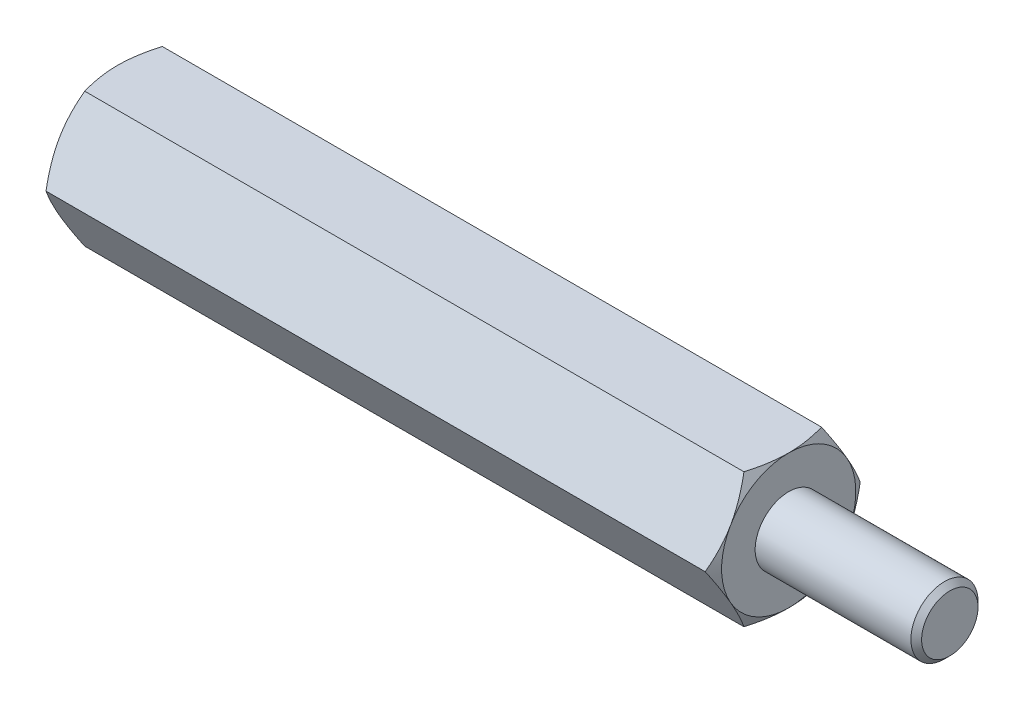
from build123d import *

# Parameters (mm, degrees)
EXTRUDE2_DEPTH = 12.5
SKETCH3_R      = 1.05
EXTRUDE3_DEPTH = 6
SKETCH5_R      = 1.25
EXTRUDE4_DEPTH = 6
CHAMFER1_SIZE  = 0.2


with BuildPart() as part:
    # Sketch1 → Extrude2 (new, symmetric)
    with BuildSketch(Plane(origin=(0, 0, 0), x_dir=(0, 0, -1), z_dir=(1, 0, 0))):
        Polygon((1.443375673, 2.5), (-1.443375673, 2.5), (-2.886751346, 0), (-1.443375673, -2.5), (1.443375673, -2.5), (2.886751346, 0), align=None)
    extrude(amount=EXTRUDE2_DEPTH, both=True)

    # Sketch2 → Cut-Revolve1 (revolve, cut)
    with BuildSketch(Plane.XY):
        with BuildLine():
            Line((-12.5, 2.5), (-11, 5.098076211))
            ThreePointArc((-11, 5.098076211), (-11.48810136, 6.276457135), (-12.5, 5.5))
            Line((-12.5, 5.5), (-12.5, 2.5))
        make_face()
    cut_revolve1 = revolve(axis=Axis((0, 0, 0), (1, 0, 0)), mode=Mode.SUBTRACT)

    # Mirror1: Cut-Revolve1 across plane
    add(cut_revolve1.mirror(Plane(origin=(0, 0, 0), x_dir=(0, 0, 1), z_dir=(1, 0, 0))), mode=Mode.SUBTRACT)

    # Sketch3 → Extrude3 (cut)
    with BuildSketch(Plane.ZY.offset(12.5)):
        Circle(SKETCH3_R)
    extrude(amount=-EXTRUDE3_DEPTH, mode=Mode.SUBTRACT)

    # Sketch4 → Cut-Revolve2 (revolve, cut)
    with BuildSketch(Plane.XY, mode=Mode.PRIVATE) as cut_revolve2_sk:
        Polygon((-6.5, 0), (-6.5, 1.05), (-5.893782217, 0), align=None)
    revolve(cut_revolve2_sk.sketch.rotate(Axis((-5.893782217, 0, 0), (-1, 0, 0)), 270), axis=Axis((-5.893782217, 0, 0), (-1, 0, 0)), mode=Mode.SUBTRACT)

    # Sketch5 → Extrude4 (add)
    with BuildSketch(Plane(origin=(12.5, 0, 0), x_dir=(0, 0, -1), z_dir=(1, 0, 0))):
        Circle(SKETCH5_R)
    extrude(amount=EXTRUDE4_DEPTH)

    # Chamfer1
    chamfer1_edges = [part.edges().sort_by_distance(p)[0] for p in [
        (18.5, 0, 1.25),
    ]]
    chamfer(chamfer1_edges, length=CHAMFER1_SIZE)


solid = part.part
